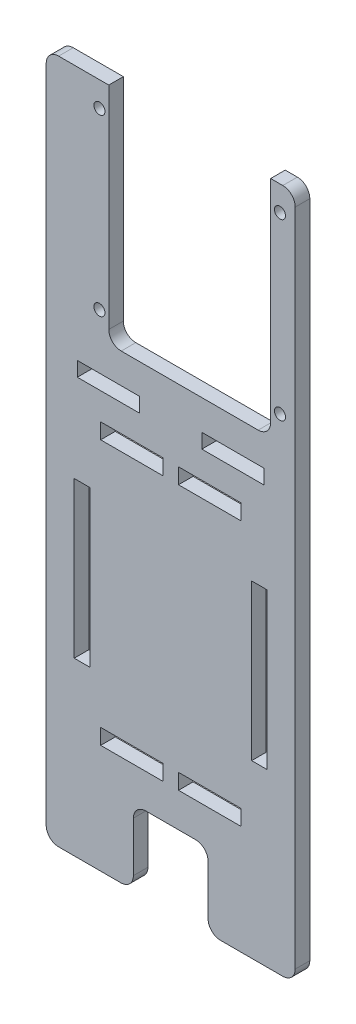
from build123d import *

# Parameters (mm, degrees)
SKETCH1_W             = 50.8
SKETCH1_H             = 139.7
BOSS_EXTRUDE1_DEPTH   = 2.9718
SKETCH3_W             = 15.24
SKETCH3_H             = 38.1
CUT_EXTRUDE2_DEPTH    = 75.38423284
SKETCH22_W            = 33.02
SKETCH22_H            = 45.72
CUT_EXTRUDE8_DEPTH    = 75.38423284
F_2_CLEARANCE_HOLE1_D = 2.2606
FILLET1_R             = 2.54
SKETCH26_W            = 3.175
SKETCH26_H            = 31.75
SKETCH26_W_2          = 12.7
SKETCH26_H_2          = 3.175
CUT_EXTRUDE9_DEPTH    = 75.38423284
SKETCH27_W            = 12.7
SKETCH27_H            = 2.9718
CUT_EXTRUDE10_DEPTH   = 75.38423284


with BuildPart() as part:
    # Sketch1 → Boss-Extrude1 (new body)
    with BuildSketch(Plane.XY):
        Rectangle(SKETCH1_W, SKETCH1_H)
    extrude(amount=BOSS_EXTRUDE1_DEPTH)

    # Sketch3 → Cut-Extrude2 (cut, through all)
    with BuildSketch(Plane.XY.offset(2.9718)):
        with Locations((0, -73.66)):
            Rectangle(SKETCH3_W, SKETCH3_H)
    extrude(amount=-CUT_EXTRUDE2_DEPTH, mode=Mode.SUBTRACT)

    # Sketch22 → Cut-Extrude8 (cut, through all)
    with BuildSketch(Plane.XY.offset(2.9718)):
        with Locations((3.872499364, 46.99)):
            Rectangle(SKETCH22_W, SKETCH22_H)
    extrude(amount=-CUT_EXTRUDE8_DEPTH, mode=Mode.SUBTRACT)

    # 2 Clearance Hole1 (through all)
    with Locations(Plane.XY.offset(2.9718)):
        with Locations((22.287499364, 29.21), (-14.542500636, 64.77), (-14.542500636, 29.21), (22.287499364, 64.77)):
            Hole(F_2_CLEARANCE_HOLE1_D / 2)

    # Fillet1
    fillet1_edges = [part.edges().sort_by_distance(p)[0] for p in [
        (7.62, -69.85, 1.4859),
        (7.62, -54.61, 1.4859),
        (-7.62, -69.85, 1.4859),
        (-7.62, -54.61, 1.4859),
        (20.382499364, 24.13, 1.4859),
        (-12.637500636, 24.13, 1.4859),
        (25.4, -69.85, 1.4859),
        (-25.4, -69.85, 1.4859),
        (-25.4, 69.85, 1.4859),
        (25.4, 69.85, 1.4859),
    ]]
    fillet(fillet1_edges, radius=FILLET1_R)

    # Sketch26 → Cut-Extrude9 (cut, through all)
    with BuildSketch(Plane.XY.offset(2.9718)):
        with Locations((18.0975, -19.05)):
            Rectangle(SKETCH26_W, SKETCH26_H)
        with Locations((7.9375, -46.0375)):
            Rectangle(SKETCH26_W_2, SKETCH26_H_2)
        with Locations((-18.0975, -19.05)):
            Rectangle(SKETCH26_W, SKETCH26_H)
        with Locations((-7.9375, -46.0375)):
            Rectangle(SKETCH26_W_2, SKETCH26_H_2)
        with Locations((-7.9375, 7.9375)):
            Rectangle(SKETCH26_W_2, SKETCH26_H_2)
        with Locations((7.9375, 7.9375)):
            Rectangle(SKETCH26_W_2, SKETCH26_H_2)
    extrude(amount=-CUT_EXTRUDE9_DEPTH, mode=Mode.SUBTRACT)

    # Sketch27 → Cut-Extrude10 (cut, through all)
    with BuildSketch(Plane.XY.offset(2.9718)):
        with Locations((12.7, 16.51)):
            Rectangle(SKETCH27_W, SKETCH27_H)
        with Locations((-12.7, 16.51)):
            Rectangle(SKETCH27_W, SKETCH27_H)
    extrude(amount=-CUT_EXTRUDE10_DEPTH, mode=Mode.SUBTRACT)


solid = part.part
